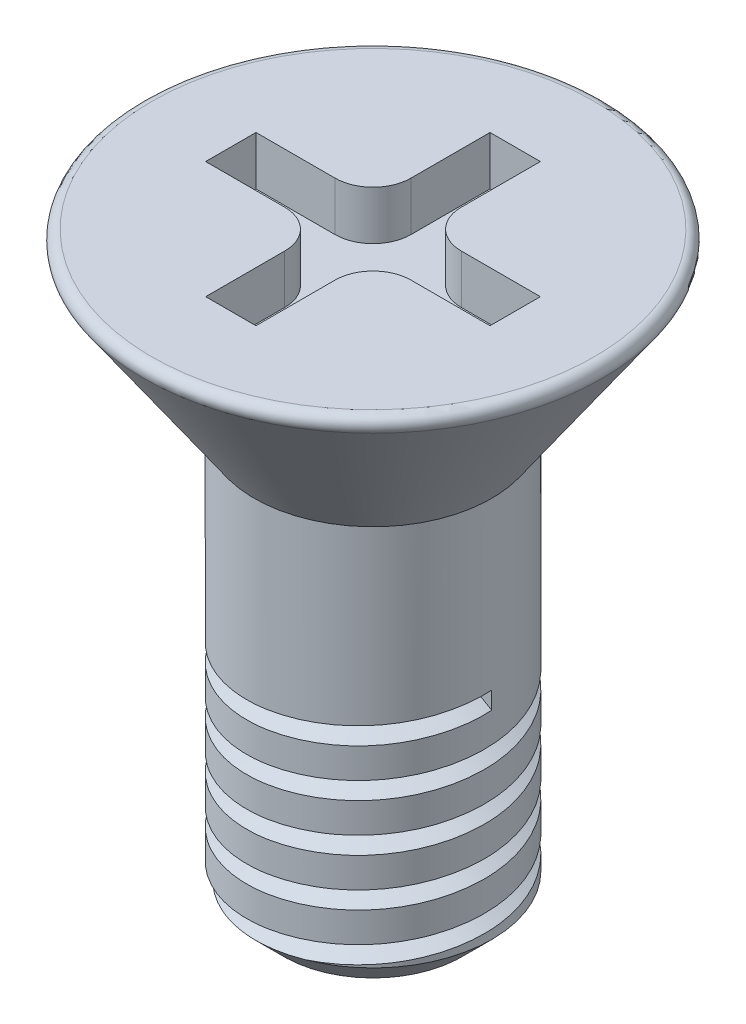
from build123d import *

# Parameters (mm, degrees)
SKETCH2_W              = 0.674503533
SKETCH2_H              = 0.655290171
CUT_EXTRUDE1_DEPTH     = 1.905
CUT_SWEEP1_PITCH       = 0.635
CUT_SWEEP1_HEIGHT      = 3.175
CUT_SWEEP1_RADIUS      = 1.590510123
CUT_SWEEP1_START_ANGLE = 90
CIRPATTERN1_COUNT      = 2
CIRPATTERN1_ANGLE      = 90
FILLET1_R              = 0.508
FILLET2_R              = 0.127


with BuildPart() as part:
    # Sketch1 → Revolve1 (revolve)
    with BuildSketch(Plane.XY):
        Polygon((1.616269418, -2.329409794), (1.616269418, -7.448083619), (2.013896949, -7.845711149), (3.206779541, -7.845711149), (3.206779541, 0), (0, 0), align=None)
    revolve(axis=Axis((3.206779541, 0, 0), (0, 1, 0)))

    # Sketch2 → Cut-Extrude1 (cut, symmetric)
    with BuildSketch(Plane.XY):
        with Locations((3.206779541, -0.327645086)):
            Rectangle(SKETCH2_W, SKETCH2_H)
    cut_extrude1 = extrude(amount=CUT_EXTRUDE1_DEPTH, both=True, mode=Mode.SUBTRACT)

    # Cut-Sweep1: sweep along a helix
    with BuildLine() as cut_sweep1_path:
        add(Helix(CUT_SWEEP1_PITCH, CUT_SWEEP1_HEIGHT, CUT_SWEEP1_RADIUS, center=(3.206779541, -7.845711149, 0), direction=(0, 1, 0), mode=Mode.PRIVATE).rotate(Axis((3.206779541, -7.845711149, 0), (0, 1, 0)), CUT_SWEEP1_START_ANGLE))
    # Sketch4 → Cut-Sweep1 (sweep, cut)
    with BuildSketch(Plane.XY):
        Polygon((4.926104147, -7.655211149), (4.926104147, -8.036211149), (4.594089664, -7.845711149), align=None)
    sweep(path=cut_sweep1_path.line, is_frenet=True, mode=Mode.SUBTRACT)

    # CirPattern1: Cut-Extrude1 ×2 about axis
    cirpattern1_axis = Axis((3.206779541, 0, 0), (0, -1, 0))
    for i in range(1, CIRPATTERN1_COUNT):
        add(cut_extrude1.rotate(cirpattern1_axis, i * CIRPATTERN1_ANGLE / (CIRPATTERN1_COUNT - 1)), mode=Mode.SUBTRACT)

    # Fillet1
    fillet1_edges = [part.edges().sort_by_distance(p)[0] for p in [
        (3.544031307, -0.327645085, 0.337251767),
        (3.544031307, -0.327645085, -0.337251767),
        (2.869527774, -0.327645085, -0.337251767),
        (2.869527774, -0.327645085, 0.337251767),
    ]]
    fillet(fillet1_edges, radius=FILLET1_R)

    # Fillet2
    fillet2_edges = [part.edges().sort_by_distance(p)[0] for p in [
        (6.413559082, 0, 0),
    ]]
    fillet(fillet2_edges, radius=FILLET2_R)


solid = part.part
